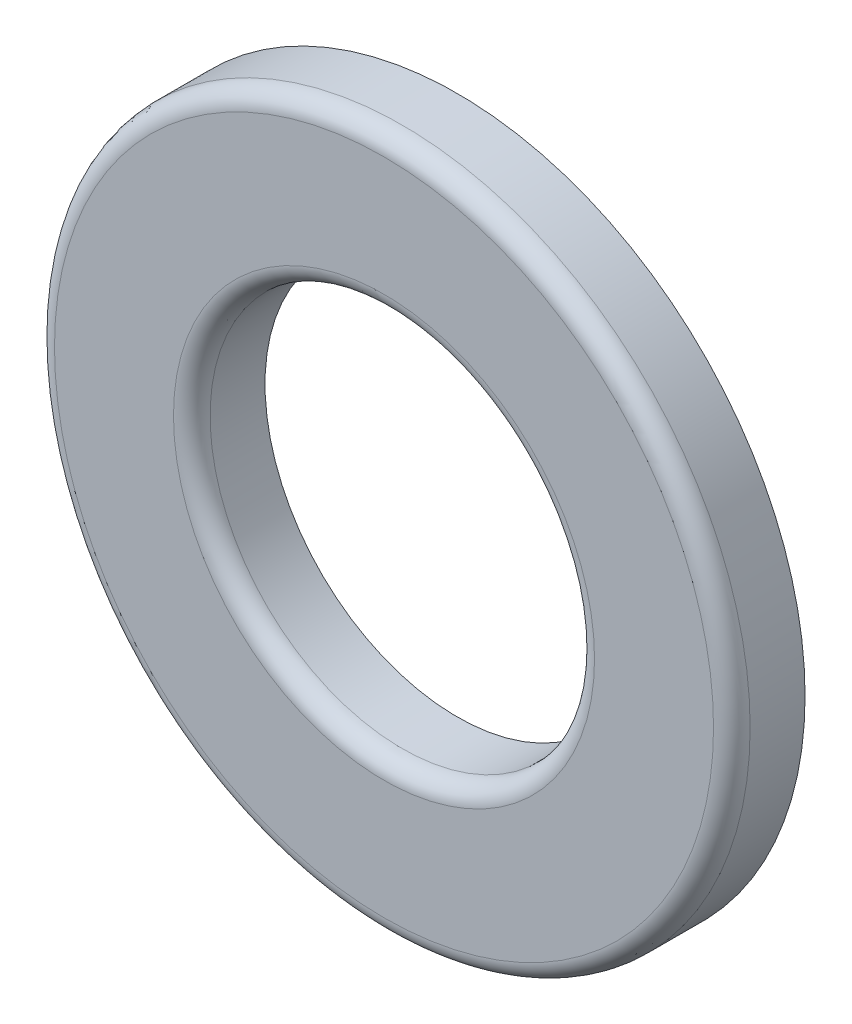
from build123d import *

# Parameters (mm, degrees)
ESQUISSE1_R          = 9.5
ESQUISSE1_R_2        = 5.25
BASE_EXTRUSION_DEPTH = 2
CONG_1_R             = 0.5


with BuildPart() as part:
    # Esquisse1 → Base-Extrusion (new body)
    with BuildSketch(Plane.XY):
        Circle(ESQUISSE1_R)
        Circle(ESQUISSE1_R_2, mode=Mode.SUBTRACT)
    extrude(amount=BASE_EXTRUSION_DEPTH)

    # Cong_1
    cong_1_edges = [part.edges().sort_by_distance(p)[0] for p in [
        (-9.5, 0, 2),
        (-5.25, 0, 2),
    ]]
    fillet(cong_1_edges, radius=CONG_1_R)


solid = part.part
